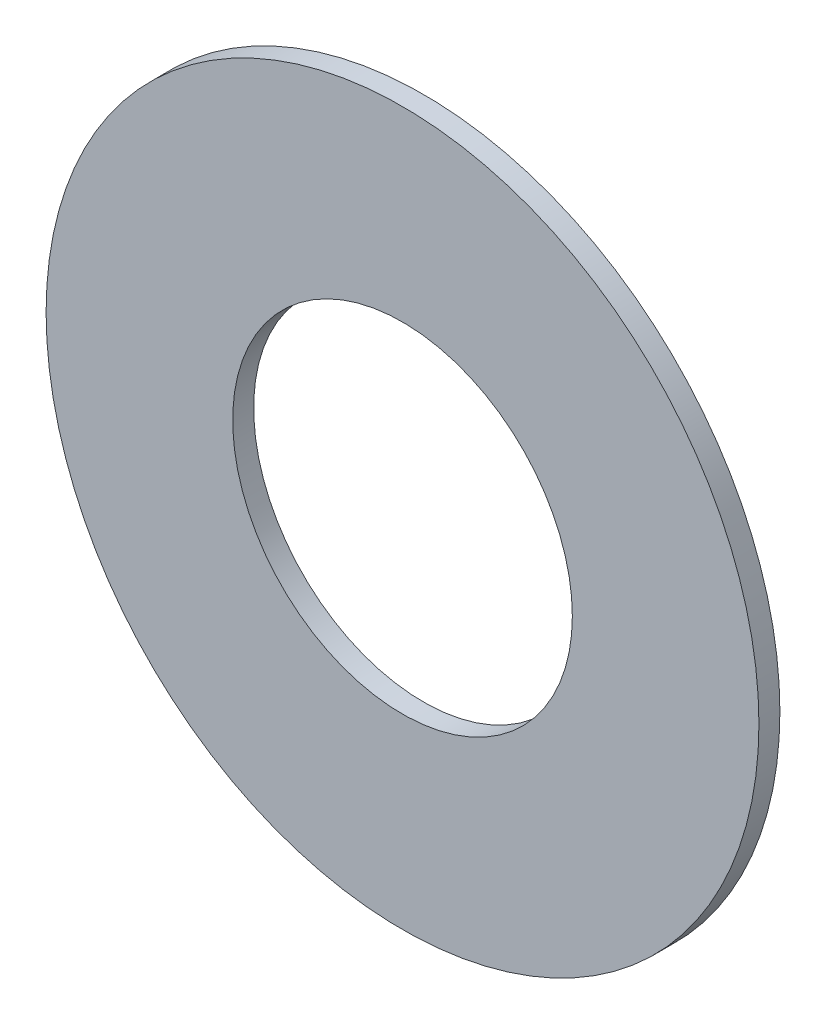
from build123d import *

# Parameters (mm, degrees)
ESQUISSE1_R          = 17
ESQUISSE1_R_2        = 8.1
BASE_EXTRUSION_DEPTH = 1


with BuildPart() as part:
    # Esquisse1 → Base-Extrusion (new body)
    with BuildSketch(Plane.XY):
        Circle(ESQUISSE1_R)
        Circle(ESQUISSE1_R_2, mode=Mode.SUBTRACT)
    extrude(amount=BASE_EXTRUSION_DEPTH)


solid = part.part
